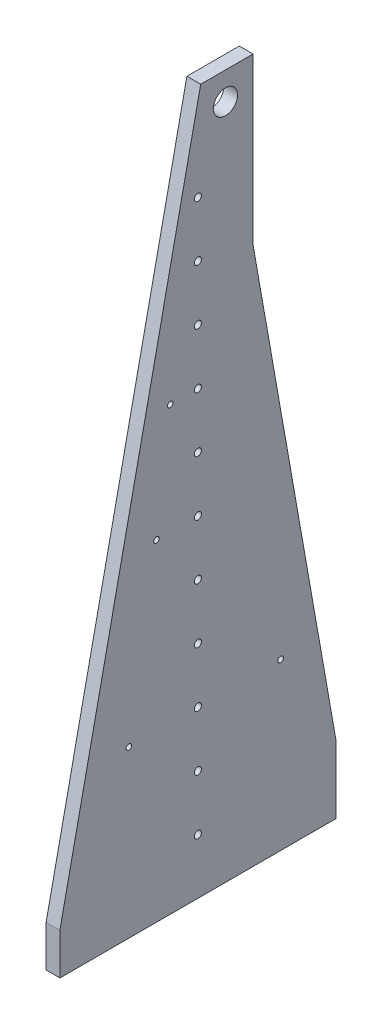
ISO-10303-21;
HEADER;
FILE_DESCRIPTION(('STEP AP214'),'2;1');
FILE_NAME('part.step','',(''),(''),'','','');
FILE_SCHEMA(('AUTOMOTIVE_DESIGN { 1 0 10303 214 1 1 1 1 }'));
ENDSEC;
DATA;
#1=APPLICATION_CONTEXT('core data for automotive mechanical design processes');
#2=APPLICATION_PROTOCOL_DEFINITION('international standard','automotive_design',2000,#1);
#3=PRODUCT_CONTEXT('',#1,'mechanical');
#4=PRODUCT('Part','Part','',(#3));
#5=PRODUCT_RELATED_PRODUCT_CATEGORY('part','',(#4));
#6=PRODUCT_DEFINITION_FORMATION('','',#4);
#7=PRODUCT_DEFINITION_CONTEXT('part definition',#1,'design');
#8=PRODUCT_DEFINITION('design','',#6,#7);
#9=PRODUCT_DEFINITION_SHAPE('','',#8);
#10=(LENGTH_UNIT() NAMED_UNIT(*) SI_UNIT(.MILLI.,.METRE.));
#11=(NAMED_UNIT(*) PLANE_ANGLE_UNIT() SI_UNIT($,.RADIAN.));
#12=(NAMED_UNIT(*) SI_UNIT($,.STERADIAN.) SOLID_ANGLE_UNIT());
#13=UNCERTAINTY_MEASURE_WITH_UNIT(LENGTH_MEASURE(1.E-05),#10,'distance_accuracy_value','');
#14=(GEOMETRIC_REPRESENTATION_CONTEXT(3) GLOBAL_UNCERTAINTY_ASSIGNED_CONTEXT((#13)) GLOBAL_UNIT_ASSIGNED_CONTEXT((#10,
#11,#12)) REPRESENTATION_CONTEXT('',''));
#15=CARTESIAN_POINT('',(0.,0.,0.));
#16=DIRECTION('',(0.,0.,1.));
#17=DIRECTION('',(1.,0.,0.));
#18=AXIS2_PLACEMENT_3D('',#15,#16,#17);
#19=CARTESIAN_POINT('',(12.7,38.1,127.));
#20=DIRECTION('',(0.,-0.20791169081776,-0.978147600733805));
#21=DIRECTION('',(0.,0.978147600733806,-0.20791169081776));
#22=AXIS2_PLACEMENT_3D('',#19,#20,#21);
#23=PLANE('',#22);
#24=DIRECTION('',(0.,-0.978147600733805,0.20791169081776));
#25=VECTOR('',#24,1.);
#26=CARTESIAN_POINT('',(0.,38.1,127.));
#27=LINE('',#26,#25);
#28=CARTESIAN_POINT('',(0.,647.7,-2.57447999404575));
#29=VERTEX_POINT('',#28);
#30=CARTESIAN_POINT('',(0.,38.1,127.));
#31=VERTEX_POINT('',#30);
#32=EDGE_CURVE('E186',#29,#31,#27,.T.);
#33=ORIENTED_EDGE('',*,*,#32,.T.);
#34=DIRECTION('',(-1.,0.,0.));
#35=VECTOR('',#34,1.);
#36=CARTESIAN_POINT('',(12.7,38.1,127.));
#37=LINE('',#36,#35);
#38=CARTESIAN_POINT('',(12.7,38.1,127.));
#39=VERTEX_POINT('',#38);
#40=EDGE_CURVE('E231',#39,#31,#37,.T.);
#41=ORIENTED_EDGE('',*,*,#40,.F.);
#42=DIRECTION('',(0.,-0.978147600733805,0.20791169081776));
#43=VECTOR('',#42,1.);
#44=CARTESIAN_POINT('',(12.7,38.1,127.));
#45=LINE('',#44,#43);
#46=CARTESIAN_POINT('',(12.7,647.7,-2.57447999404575));
#47=VERTEX_POINT('',#46);
#48=EDGE_CURVE('E187',#47,#39,#45,.T.);
#49=ORIENTED_EDGE('',*,*,#48,.F.);
#50=DIRECTION('',(-1.,0.,0.));
#51=VECTOR('',#50,1.);
#52=CARTESIAN_POINT('',(12.7,647.7,-2.57447999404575));
#53=LINE('',#52,#51);
#54=EDGE_CURVE('E203',#47,#29,#53,.T.);
#55=ORIENTED_EDGE('',*,*,#54,.T.);
#56=EDGE_LOOP('',(#33,#41,#49,#55));
#57=FACE_BOUND('',#56,.T.);
#58=ADVANCED_FACE('F37',(#57),#23,.F.);
#59=CARTESIAN_POINT('',(12.7,0.,127.));
#60=DIRECTION('',(0.,0.,-1.));
#61=DIRECTION('',(-1.,0.,0.));
#62=AXIS2_PLACEMENT_3D('',#59,#60,#61);
#63=PLANE('',#62);
#64=DIRECTION('',(0.,-1.,0.));
#65=VECTOR('',#64,1.);
#66=CARTESIAN_POINT('',(0.,0.,127.));
#67=LINE('',#66,#65);
#68=CARTESIAN_POINT('',(0.,0.,127.));
#69=VERTEX_POINT('',#68);
#70=EDGE_CURVE('E206',#31,#69,#67,.T.);
#71=ORIENTED_EDGE('',*,*,#70,.T.);
#72=DIRECTION('',(-1.,0.,0.));
#73=VECTOR('',#72,1.);
#74=CARTESIAN_POINT('',(12.7,0.,127.));
#75=LINE('',#74,#73);
#76=CARTESIAN_POINT('',(12.7,0.,127.));
#77=VERTEX_POINT('',#76);
#78=EDGE_CURVE('E228',#77,#69,#75,.T.);
#79=ORIENTED_EDGE('',*,*,#78,.F.);
#80=DIRECTION('',(0.,-1.,0.));
#81=VECTOR('',#80,1.);
#82=CARTESIAN_POINT('',(12.7,0.,127.));
#83=LINE('',#82,#81);
#84=EDGE_CURVE('E190',#39,#77,#83,.T.);
#85=ORIENTED_EDGE('',*,*,#84,.F.);
#86=ORIENTED_EDGE('',*,*,#40,.T.);
#87=EDGE_LOOP('',(#71,#79,#85,#86));
#88=FACE_BOUND('',#87,.T.);
#89=ADVANCED_FACE('F266',(#88),#63,.F.);
#90=CARTESIAN_POINT('',(12.7,0.,-127.));
#91=DIRECTION('',(0.,1.,0.));
#92=DIRECTION('',(0.,0.,1.));
#93=AXIS2_PLACEMENT_3D('',#90,#91,#92);
#94=PLANE('',#93);
#95=CARTESIAN_POINT('',(6.35,0.,-101.6));
#96=DIRECTION('',(0.,-1.,0.));
#97=DIRECTION('',(0.,0.,-1.));
#98=AXIS2_PLACEMENT_3D('',#95,#96,#97);
#99=CIRCLE('',#98,2.55269999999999);
#100=CARTESIAN_POINT('',(6.35,0.,-104.1527));
#101=VERTEX_POINT('',#100);
#102=EDGE_CURVE('E126',#101,#101,#99,.T.);
#103=ORIENTED_EDGE('',*,*,#102,.F.);
#104=EDGE_LOOP('',(#103));
#105=FACE_BOUND('',#104,.T.);
#106=CARTESIAN_POINT('',(6.34999999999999,0.,-50.8));
#107=DIRECTION('',(0.,-1.,0.));
#108=DIRECTION('',(0.,0.,-1.));
#109=AXIS2_PLACEMENT_3D('',#106,#107,#108);
#110=CIRCLE('',#109,2.55269999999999);
#111=CARTESIAN_POINT('',(6.34999999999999,0.,-53.3527));
#112=VERTEX_POINT('',#111);
#113=EDGE_CURVE('E125',#112,#112,#110,.T.);
#114=ORIENTED_EDGE('',*,*,#113,.F.);
#115=EDGE_LOOP('',(#114));
#116=FACE_BOUND('',#115,.T.);
#117=CARTESIAN_POINT('',(6.34999999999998,0.,0.));
#118=DIRECTION('',(0.,-1.,0.));
#119=DIRECTION('',(0.,0.,-1.));
#120=AXIS2_PLACEMENT_3D('',#117,#118,#119);
#121=CIRCLE('',#120,2.55269999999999);
#122=CARTESIAN_POINT('',(6.34999999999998,0.,-2.55269999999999));
#123=VERTEX_POINT('',#122);
#124=EDGE_CURVE('E138',#123,#123,#121,.T.);
#125=ORIENTED_EDGE('',*,*,#124,.F.);
#126=EDGE_LOOP('',(#125));
#127=FACE_BOUND('',#126,.T.);
#128=CARTESIAN_POINT('',(6.34999999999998,0.,50.8));
#129=DIRECTION('',(0.,-1.,0.));
#130=DIRECTION('',(0.,0.,-1.));
#131=AXIS2_PLACEMENT_3D('',#128,#129,#130);
#132=CIRCLE('',#131,2.55269999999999);
#133=CARTESIAN_POINT('',(6.34999999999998,0.,48.2473));
#134=VERTEX_POINT('',#133);
#135=EDGE_CURVE('E144',#134,#134,#132,.T.);
#136=ORIENTED_EDGE('',*,*,#135,.F.);
#137=EDGE_LOOP('',(#136));
#138=FACE_BOUND('',#137,.T.);
#139=CARTESIAN_POINT('',(6.34999999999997,0.,101.6));
#140=DIRECTION('',(0.,-1.,0.));
#141=DIRECTION('',(0.,0.,-1.));
#142=AXIS2_PLACEMENT_3D('',#139,#140,#141);
#143=CIRCLE('',#142,2.55269999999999);
#144=CARTESIAN_POINT('',(6.34999999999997,0.,99.0473));
#145=VERTEX_POINT('',#144);
#146=EDGE_CURVE('E150',#145,#145,#143,.T.);
#147=ORIENTED_EDGE('',*,*,#146,.F.);
#148=EDGE_LOOP('',(#147));
#149=FACE_BOUND('',#148,.T.);
#150=DIRECTION('',(0.,0.,-1.));
#151=VECTOR('',#150,1.);
#152=CARTESIAN_POINT('',(0.,0.,-127.));
#153=LINE('',#152,#151);
#154=CARTESIAN_POINT('',(0.,0.,-127.));
#155=VERTEX_POINT('',#154);
#156=EDGE_CURVE('E208',#69,#155,#153,.T.);
#157=ORIENTED_EDGE('',*,*,#156,.T.);
#158=DIRECTION('',(-1.,0.,0.));
#159=VECTOR('',#158,1.);
#160=CARTESIAN_POINT('',(12.7,0.,-127.));
#161=LINE('',#160,#159);
#162=CARTESIAN_POINT('',(12.7,0.,-127.));
#163=VERTEX_POINT('',#162);
#164=EDGE_CURVE('E225',#163,#155,#161,.T.);
#165=ORIENTED_EDGE('',*,*,#164,.F.);
#166=DIRECTION('',(0.,0.,-1.));
#167=VECTOR('',#166,1.);
#168=CARTESIAN_POINT('',(12.7,0.,-127.));
#169=LINE('',#168,#167);
#170=EDGE_CURVE('E193',#77,#163,#169,.T.);
#171=ORIENTED_EDGE('',*,*,#170,.F.);
#172=ORIENTED_EDGE('',*,*,#78,.T.);
#173=EDGE_LOOP('',(#157,#165,#171,#172));
#174=FACE_BOUND('',#173,.T.);
#175=ADVANCED_FACE('F270',(#105,#116,#127,#138,#149,#174),#94,.F.);
#176=CARTESIAN_POINT('',(12.7,63.1483253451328,-127.));
#177=DIRECTION('',(0.,0.,1.));
#178=DIRECTION('',(1.,0.,0.));
#179=AXIS2_PLACEMENT_3D('',#176,#177,#178);
#180=PLANE('',#179);
#181=DIRECTION('',(0.,1.,0.));
#182=VECTOR('',#181,1.);
#183=CARTESIAN_POINT('',(0.,63.1483253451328,-127.));
#184=LINE('',#183,#182);
#185=CARTESIAN_POINT('',(0.,63.1483253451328,-127.));
#186=VERTEX_POINT('',#185);
#187=EDGE_CURVE('E210',#155,#186,#184,.T.);
#188=ORIENTED_EDGE('',*,*,#187,.T.);
#189=DIRECTION('',(-1.,0.,0.));
#190=VECTOR('',#189,1.);
#191=CARTESIAN_POINT('',(12.7,63.1483253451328,-127.));
#192=LINE('',#191,#190);
#193=CARTESIAN_POINT('',(12.7,63.1483253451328,-127.));
#194=VERTEX_POINT('',#193);
#195=EDGE_CURVE('E222',#194,#186,#192,.T.);
#196=ORIENTED_EDGE('',*,*,#195,.F.);
#197=DIRECTION('',(0.,1.,0.));
#198=VECTOR('',#197,1.);
#199=CARTESIAN_POINT('',(12.7,63.1483253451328,-127.));
#200=LINE('',#199,#198);
#201=EDGE_CURVE('E195',#163,#194,#200,.T.);
#202=ORIENTED_EDGE('',*,*,#201,.F.);
#203=ORIENTED_EDGE('',*,*,#164,.T.);
#204=EDGE_LOOP('',(#188,#196,#202,#203));
#205=FACE_BOUND('',#204,.T.);
#206=ADVANCED_FACE('F276',(#205),#180,.F.);
#207=CARTESIAN_POINT('',(12.7,495.3,-50.7999999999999));
#208=DIRECTION('',(0.,-0.173648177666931,0.984807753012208));
#209=DIRECTION('',(0.,-0.984807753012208,-0.173648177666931));
#210=AXIS2_PLACEMENT_3D('',#207,#208,#209);
#211=PLANE('',#210);
#212=DIRECTION('',(0.,0.984807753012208,0.173648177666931));
#213=VECTOR('',#212,1.);
#214=CARTESIAN_POINT('',(0.,495.3,-50.7999999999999));
#215=LINE('',#214,#213);
#216=CARTESIAN_POINT('',(0.,494.468388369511,-50.9466355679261));
#217=VERTEX_POINT('',#216);
#218=EDGE_CURVE('E212',#186,#217,#215,.T.);
#219=ORIENTED_EDGE('',*,*,#218,.T.);
#220=DIRECTION('',(-1.,0.,0.));
#221=VECTOR('',#220,1.);
#222=CARTESIAN_POINT('',(12.7,494.468388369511,-50.9466355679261));
#223=LINE('',#222,#221);
#224=CARTESIAN_POINT('',(12.7,494.468388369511,-50.9466355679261));
#225=VERTEX_POINT('',#224);
#226=EDGE_CURVE('E52',#217,#225,#223,.F.);
#227=ORIENTED_EDGE('',*,*,#226,.T.);
#228=DIRECTION('',(0.,0.984807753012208,0.173648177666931));
#229=VECTOR('',#228,1.);
#230=CARTESIAN_POINT('',(12.7,495.3,-50.7999999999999));
#231=LINE('',#230,#229);
#232=EDGE_CURVE('E197',#194,#225,#231,.T.);
#233=ORIENTED_EDGE('',*,*,#232,.F.);
#234=ORIENTED_EDGE('',*,*,#195,.T.);
#235=EDGE_LOOP('',(#219,#227,#233,#234));
#236=FACE_BOUND('',#235,.T.);
#237=ADVANCED_FACE('F280',(#236),#211,.F.);
#238=CARTESIAN_POINT('',(12.7,647.7,-50.7999999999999));
#239=DIRECTION('',(0.,0.,1.));
#240=DIRECTION('',(0.,-1.,0.));
#241=AXIS2_PLACEMENT_3D('',#238,#239,#240);
#242=PLANE('',#241);
#243=DIRECTION('',(0.,1.,0.));
#244=VECTOR('',#243,1.);
#245=CARTESIAN_POINT('',(12.7,647.7,-50.7999999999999));
#246=LINE('',#245,#244);
#247=CARTESIAN_POINT('',(12.7,496.144440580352,-50.7999999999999));
#248=VERTEX_POINT('',#247);
#249=CARTESIAN_POINT('',(12.7,647.7,-50.7999999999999));
#250=VERTEX_POINT('',#249);
#251=EDGE_CURVE('E199',#248,#250,#246,.T.);
#252=ORIENTED_EDGE('',*,*,#251,.F.);
#253=DIRECTION('',(-1.,0.,0.));
#254=VECTOR('',#253,1.);
#255=CARTESIAN_POINT('',(0.,496.144440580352,-50.7999999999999));
#256=LINE('',#255,#254);
#257=CARTESIAN_POINT('',(0.,496.144440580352,-50.7999999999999));
#258=VERTEX_POINT('',#257);
#259=EDGE_CURVE('E234',#248,#258,#256,.T.);
#260=ORIENTED_EDGE('',*,*,#259,.T.);
#261=DIRECTION('',(0.,1.,0.));
#262=VECTOR('',#261,1.);
#263=CARTESIAN_POINT('',(0.,647.7,-50.7999999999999));
#264=LINE('',#263,#262);
#265=CARTESIAN_POINT('',(0.,647.7,-50.7999999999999));
#266=VERTEX_POINT('',#265);
#267=EDGE_CURVE('E214',#258,#266,#264,.T.);
#268=ORIENTED_EDGE('',*,*,#267,.T.);
#269=DIRECTION('',(-1.,0.,0.));
#270=VECTOR('',#269,1.);
#271=CARTESIAN_POINT('',(12.7,647.7,-50.7999999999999));
#272=LINE('',#271,#270);
#273=EDGE_CURVE('E219',#250,#266,#272,.T.);
#274=ORIENTED_EDGE('',*,*,#273,.F.);
#275=EDGE_LOOP('',(#252,#260,#268,#274));
#276=FACE_BOUND('',#275,.T.);
#277=ADVANCED_FACE('F240',(#276),#242,.F.);
#278=CARTESIAN_POINT('',(12.7,647.7,-2.57447999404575));
#279=DIRECTION('',(0.,-1.,0.));
#280=DIRECTION('',(0.,0.,-1.));
#281=AXIS2_PLACEMENT_3D('',#278,#279,#280);
#282=PLANE('',#281);
#283=DIRECTION('',(0.,0.,1.));
#284=VECTOR('',#283,1.);
#285=CARTESIAN_POINT('',(0.,647.7,-2.57447999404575));
#286=LINE('',#285,#284);
#287=EDGE_CURVE('E191',#266,#29,#286,.T.);
#288=ORIENTED_EDGE('',*,*,#287,.T.);
#289=ORIENTED_EDGE('',*,*,#54,.F.);
#290=DIRECTION('',(0.,0.,1.));
#291=VECTOR('',#290,1.);
#292=CARTESIAN_POINT('',(12.7,647.7,-2.57447999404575));
#293=LINE('',#292,#291);
#294=EDGE_CURVE('E201',#250,#47,#293,.T.);
#295=ORIENTED_EDGE('',*,*,#294,.F.);
#296=ORIENTED_EDGE('',*,*,#273,.T.);
#297=EDGE_LOOP('',(#288,#289,#295,#296));
#298=FACE_BOUND('',#297,.T.);
#299=ADVANCED_FACE('F249',(#298),#282,.F.);
#300=CARTESIAN_POINT('',(12.7,0.,0.));
#301=DIRECTION('',(-1.,0.,0.));
#302=DIRECTION('',(0.,0.,1.));
#303=AXIS2_PLACEMENT_3D('',#300,#301,#302);
#304=PLANE('',#303);
#305=CARTESIAN_POINT('',(12.7,558.8,0.));
#306=DIRECTION('',(-1.,0.,0.));
#307=DIRECTION('',(0.,0.,1.));
#308=AXIS2_PLACEMENT_3D('',#305,#306,#307);
#309=CIRCLE('',#308,3.26389999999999);
#310=CARTESIAN_POINT('',(12.7,558.8,3.26389999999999));
#311=VERTEX_POINT('',#310);
#312=EDGE_CURVE('E484',#311,#311,#309,.T.);
#313=ORIENTED_EDGE('',*,*,#312,.T.);
#314=EDGE_LOOP('',(#313));
#315=FACE_BOUND('',#314,.T.);
#316=CARTESIAN_POINT('',(12.7,508.,0.));
#317=DIRECTION('',(-1.,0.,0.));
#318=DIRECTION('',(0.,0.,1.));
#319=AXIS2_PLACEMENT_3D('',#316,#317,#318);
#320=CIRCLE('',#319,3.26389999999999);
#321=CARTESIAN_POINT('',(12.7,508.,3.26389999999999));
#322=VERTEX_POINT('',#321);
#323=EDGE_CURVE('E500',#322,#322,#320,.T.);
#324=ORIENTED_EDGE('',*,*,#323,.T.);
#325=EDGE_LOOP('',(#324));
#326=FACE_BOUND('',#325,.T.);
#327=CARTESIAN_POINT('',(12.7,457.2,0.));
#328=DIRECTION('',(-1.,0.,0.));
#329=DIRECTION('',(0.,0.,1.));
#330=AXIS2_PLACEMENT_3D('',#327,#328,#329);
#331=CIRCLE('',#330,3.26389999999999);
#332=CARTESIAN_POINT('',(12.7,457.2,3.26389999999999));
#333=VERTEX_POINT('',#332);
#334=EDGE_CURVE('E512',#333,#333,#331,.T.);
#335=ORIENTED_EDGE('',*,*,#334,.T.);
#336=EDGE_LOOP('',(#335));
#337=FACE_BOUND('',#336,.T.);
#338=CARTESIAN_POINT('',(12.7,406.4,0.));
#339=DIRECTION('',(-1.,0.,0.));
#340=DIRECTION('',(0.,0.,1.));
#341=AXIS2_PLACEMENT_3D('',#338,#339,#340);
#342=CIRCLE('',#341,3.26389999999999);
#343=CARTESIAN_POINT('',(12.7,406.4,3.26389999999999));
#344=VERTEX_POINT('',#343);
#345=EDGE_CURVE('E524',#344,#344,#342,.T.);
#346=ORIENTED_EDGE('',*,*,#345,.T.);
#347=EDGE_LOOP('',(#346));
#348=FACE_BOUND('',#347,.T.);
#349=CARTESIAN_POINT('',(12.7,355.6,0.));
#350=DIRECTION('',(-1.,0.,0.));
#351=DIRECTION('',(0.,0.,1.));
#352=AXIS2_PLACEMENT_3D('',#349,#350,#351);
#353=CIRCLE('',#352,3.26389999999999);
#354=CARTESIAN_POINT('',(12.7,355.6,3.26389999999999));
#355=VERTEX_POINT('',#354);
#356=EDGE_CURVE('E536',#355,#355,#353,.T.);
#357=ORIENTED_EDGE('',*,*,#356,.T.);
#358=EDGE_LOOP('',(#357));
#359=FACE_BOUND('',#358,.T.);
#360=CARTESIAN_POINT('',(12.7,304.8,0.));
#361=DIRECTION('',(-1.,0.,0.));
#362=DIRECTION('',(0.,0.,1.));
#363=AXIS2_PLACEMENT_3D('',#360,#361,#362);
#364=CIRCLE('',#363,3.26389999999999);
#365=CARTESIAN_POINT('',(12.7,304.8,3.26389999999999));
#366=VERTEX_POINT('',#365);
#367=EDGE_CURVE('E548',#366,#366,#364,.T.);
#368=ORIENTED_EDGE('',*,*,#367,.T.);
#369=EDGE_LOOP('',(#368));
#370=FACE_BOUND('',#369,.T.);
#371=CARTESIAN_POINT('',(12.7,254.,0.));
#372=DIRECTION('',(-1.,0.,0.));
#373=DIRECTION('',(0.,0.,1.));
#374=AXIS2_PLACEMENT_3D('',#371,#372,#373);
#375=CIRCLE('',#374,3.26389999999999);
#376=CARTESIAN_POINT('',(12.7,254.,3.26389999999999));
#377=VERTEX_POINT('',#376);
#378=EDGE_CURVE('E560',#377,#377,#375,.T.);
#379=ORIENTED_EDGE('',*,*,#378,.T.);
#380=EDGE_LOOP('',(#379));
#381=FACE_BOUND('',#380,.T.);
#382=CARTESIAN_POINT('',(12.7,203.2,0.));
#383=DIRECTION('',(-1.,0.,0.));
#384=DIRECTION('',(0.,0.,1.));
#385=AXIS2_PLACEMENT_3D('',#382,#383,#384);
#386=CIRCLE('',#385,3.26389999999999);
#387=CARTESIAN_POINT('',(12.7,203.2,3.26389999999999));
#388=VERTEX_POINT('',#387);
#389=EDGE_CURVE('E572',#388,#388,#386,.T.);
#390=ORIENTED_EDGE('',*,*,#389,.T.);
#391=EDGE_LOOP('',(#390));
#392=FACE_BOUND('',#391,.T.);
#393=CARTESIAN_POINT('',(12.7,152.4,0.));
#394=DIRECTION('',(-1.,0.,0.));
#395=DIRECTION('',(0.,0.,1.));
#396=AXIS2_PLACEMENT_3D('',#393,#394,#395);
#397=CIRCLE('',#396,3.26389999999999);
#398=CARTESIAN_POINT('',(12.7,152.4,3.26389999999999));
#399=VERTEX_POINT('',#398);
#400=EDGE_CURVE('E584',#399,#399,#397,.T.);
#401=ORIENTED_EDGE('',*,*,#400,.T.);
#402=EDGE_LOOP('',(#401));
#403=FACE_BOUND('',#402,.T.);
#404=CARTESIAN_POINT('',(12.7,101.6,0.));
#405=DIRECTION('',(-1.,0.,0.));
#406=DIRECTION('',(0.,0.,1.));
#407=AXIS2_PLACEMENT_3D('',#404,#405,#406);
#408=CIRCLE('',#407,3.2639);
#409=CARTESIAN_POINT('',(12.7,101.6,3.2639));
#410=VERTEX_POINT('',#409);
#411=EDGE_CURVE('E596',#410,#410,#408,.T.);
#412=ORIENTED_EDGE('',*,*,#411,.T.);
#413=EDGE_LOOP('',(#412));
#414=FACE_BOUND('',#413,.T.);
#415=CARTESIAN_POINT('',(12.7,50.8,0.));
#416=DIRECTION('',(-1.,0.,0.));
#417=DIRECTION('',(0.,0.,1.));
#418=AXIS2_PLACEMENT_3D('',#415,#416,#417);
#419=CIRCLE('',#418,3.2639);
#420=CARTESIAN_POINT('',(12.7,50.8,3.2639));
#421=VERTEX_POINT('',#420);
#422=EDGE_CURVE('E132',#421,#421,#419,.T.);
#423=ORIENTED_EDGE('',*,*,#422,.T.);
#424=EDGE_LOOP('',(#423));
#425=FACE_BOUND('',#424,.T.);
#426=CARTESIAN_POINT('',(12.7,406.4,25.4));
#427=DIRECTION('',(1.,0.,0.));
#428=DIRECTION('',(0.,0.,-1.));
#429=AXIS2_PLACEMENT_3D('',#426,#427,#428);
#430=CIRCLE('',#429,2.55270000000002);
#431=CARTESIAN_POINT('',(12.7,406.4,22.8473));
#432=VERTEX_POINT('',#431);
#433=EDGE_CURVE('E156',#432,#432,#430,.T.);
#434=ORIENTED_EDGE('',*,*,#433,.F.);
#435=EDGE_LOOP('',(#434));
#436=FACE_BOUND('',#435,.T.);
#437=CARTESIAN_POINT('',(12.7,304.8,38.1));
#438=DIRECTION('',(1.,0.,0.));
#439=DIRECTION('',(0.,0.,-1.));
#440=AXIS2_PLACEMENT_3D('',#437,#438,#439);
#441=CIRCLE('',#440,2.55270000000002);
#442=CARTESIAN_POINT('',(12.7,304.8,35.5473));
#443=VERTEX_POINT('',#442);
#444=EDGE_CURVE('E162',#443,#443,#441,.T.);
#445=ORIENTED_EDGE('',*,*,#444,.F.);
#446=EDGE_LOOP('',(#445));
#447=FACE_BOUND('',#446,.T.);
#448=CARTESIAN_POINT('',(12.7,152.4,63.5));
#449=DIRECTION('',(1.,0.,0.));
#450=DIRECTION('',(0.,0.,-1.));
#451=AXIS2_PLACEMENT_3D('',#448,#449,#450);
#452=CIRCLE('',#451,2.55269999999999);
#453=CARTESIAN_POINT('',(12.7,152.4,60.9473));
#454=VERTEX_POINT('',#453);
#455=EDGE_CURVE('E168',#454,#454,#452,.T.);
#456=ORIENTED_EDGE('',*,*,#455,.F.);
#457=EDGE_LOOP('',(#456));
#458=FACE_BOUND('',#457,.T.);
#459=CARTESIAN_POINT('',(12.7,152.4,-76.2));
#460=DIRECTION('',(1.,0.,0.));
#461=DIRECTION('',(0.,0.,-1.));
#462=AXIS2_PLACEMENT_3D('',#459,#460,#461);
#463=CIRCLE('',#462,2.55269999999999);
#464=CARTESIAN_POINT('',(12.7,152.4,-78.7527));
#465=VERTEX_POINT('',#464);
#466=EDGE_CURVE('E174',#465,#465,#463,.T.);
#467=ORIENTED_EDGE('',*,*,#466,.F.);
#468=EDGE_LOOP('',(#467));
#469=FACE_BOUND('',#468,.T.);
#470=CARTESIAN_POINT('',(12.7,622.3,-25.3999999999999));
#471=DIRECTION('',(1.,0.,0.));
#472=DIRECTION('',(0.,0.,-1.));
#473=AXIS2_PLACEMENT_3D('',#470,#471,#472);
#474=CIRCLE('',#473,11.1125);
#475=CARTESIAN_POINT('',(12.7,622.3,-36.5124999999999));
#476=VERTEX_POINT('',#475);
#477=EDGE_CURVE('E180',#476,#476,#474,.T.);
#478=ORIENTED_EDGE('',*,*,#477,.F.);
#479=EDGE_LOOP('',(#478));
#480=FACE_BOUND('',#479,.T.);
#481=ORIENTED_EDGE('',*,*,#48,.T.);
#482=ORIENTED_EDGE('',*,*,#84,.T.);
#483=ORIENTED_EDGE('',*,*,#170,.T.);
#484=ORIENTED_EDGE('',*,*,#201,.T.);
#485=ORIENTED_EDGE('',*,*,#232,.T.);
#486=CARTESIAN_POINT('',(12.7,496.144440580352,-60.4519999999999));
#487=DIRECTION('',(-1.,0.,0.));
#488=DIRECTION('',(0.,0.,1.));
#489=AXIS2_PLACEMENT_3D('',#486,#487,#488);
#490=CIRCLE('',#489,9.652);
#491=EDGE_CURVE('E11',#225,#248,#490,.T.);
#492=ORIENTED_EDGE('',*,*,#491,.T.);
#493=ORIENTED_EDGE('',*,*,#251,.T.);
#494=ORIENTED_EDGE('',*,*,#294,.T.);
#495=EDGE_LOOP('',(#481,#482,#483,#484,#485,#492,#493,#494));
#496=FACE_BOUND('',#495,.T.);
#497=ADVANCED_FACE('F255',(#315,#326,#337,#348,#359,#370,#381,#392,#403,#414,#425,#436,#447,
#458,#469,#480,#496),#304,.F.);
#498=CARTESIAN_POINT('',(0.,0.,0.));
#499=DIRECTION('',(-1.,0.,0.));
#500=DIRECTION('',(0.,0.,1.));
#501=AXIS2_PLACEMENT_3D('',#498,#499,#500);
#502=PLANE('',#501);
#503=CARTESIAN_POINT('',(0.,558.8,0.));
#504=DIRECTION('',(-1.,0.,0.));
#505=DIRECTION('',(0.,0.,1.));
#506=AXIS2_PLACEMENT_3D('',#503,#504,#505);
#507=CIRCLE('',#506,5.55625000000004);
#508=CARTESIAN_POINT('',(0.,558.8,5.55625000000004));
#509=VERTEX_POINT('',#508);
#510=EDGE_CURVE('E482',#509,#509,#507,.T.);
#511=ORIENTED_EDGE('',*,*,#510,.F.);
#512=EDGE_LOOP('',(#511));
#513=FACE_BOUND('',#512,.T.);
#514=CARTESIAN_POINT('',(0.,508.,0.));
#515=DIRECTION('',(-1.,0.,0.));
#516=DIRECTION('',(0.,0.,1.));
#517=AXIS2_PLACEMENT_3D('',#514,#515,#516);
#518=CIRCLE('',#517,5.55625000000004);
#519=CARTESIAN_POINT('',(0.,508.,5.55625000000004));
#520=VERTEX_POINT('',#519);
#521=EDGE_CURVE('E491',#520,#520,#518,.T.);
#522=ORIENTED_EDGE('',*,*,#521,.F.);
#523=EDGE_LOOP('',(#522));
#524=FACE_BOUND('',#523,.T.);
#525=CARTESIAN_POINT('',(0.,457.2,0.));
#526=DIRECTION('',(-1.,0.,0.));
#527=DIRECTION('',(0.,0.,1.));
#528=AXIS2_PLACEMENT_3D('',#525,#526,#527);
#529=CIRCLE('',#528,5.55624999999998);
#530=CARTESIAN_POINT('',(0.,457.2,5.55624999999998));
#531=VERTEX_POINT('',#530);
#532=EDGE_CURVE('E503',#531,#531,#529,.T.);
#533=ORIENTED_EDGE('',*,*,#532,.F.);
#534=EDGE_LOOP('',(#533));
#535=FACE_BOUND('',#534,.T.);
#536=CARTESIAN_POINT('',(0.,406.4,0.));
#537=DIRECTION('',(-1.,0.,0.));
#538=DIRECTION('',(0.,0.,1.));
#539=AXIS2_PLACEMENT_3D('',#536,#537,#538);
#540=CIRCLE('',#539,5.55624999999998);
#541=CARTESIAN_POINT('',(0.,406.4,5.55624999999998));
#542=VERTEX_POINT('',#541);
#543=EDGE_CURVE('E515',#542,#542,#540,.T.);
#544=ORIENTED_EDGE('',*,*,#543,.F.);
#545=EDGE_LOOP('',(#544));
#546=FACE_BOUND('',#545,.T.);
#547=CARTESIAN_POINT('',(0.,355.6,0.));
#548=DIRECTION('',(-1.,0.,0.));
#549=DIRECTION('',(0.,0.,1.));
#550=AXIS2_PLACEMENT_3D('',#547,#548,#549);
#551=CIRCLE('',#550,5.55624999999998);
#552=CARTESIAN_POINT('',(0.,355.6,5.55624999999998));
#553=VERTEX_POINT('',#552);
#554=EDGE_CURVE('E527',#553,#553,#551,.T.);
#555=ORIENTED_EDGE('',*,*,#554,.F.);
#556=EDGE_LOOP('',(#555));
#557=FACE_BOUND('',#556,.T.);
#558=CARTESIAN_POINT('',(0.,304.8,0.));
#559=DIRECTION('',(-1.,0.,0.));
#560=DIRECTION('',(0.,0.,1.));
#561=AXIS2_PLACEMENT_3D('',#558,#559,#560);
#562=CIRCLE('',#561,5.55624999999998);
#563=CARTESIAN_POINT('',(0.,304.8,5.55624999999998));
#564=VERTEX_POINT('',#563);
#565=EDGE_CURVE('E539',#564,#564,#562,.T.);
#566=ORIENTED_EDGE('',*,*,#565,.F.);
#567=EDGE_LOOP('',(#566));
#568=FACE_BOUND('',#567,.T.);
#569=CARTESIAN_POINT('',(0.,254.,0.));
#570=DIRECTION('',(-1.,0.,0.));
#571=DIRECTION('',(0.,0.,1.));
#572=AXIS2_PLACEMENT_3D('',#569,#570,#571);
#573=CIRCLE('',#572,5.55624999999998);
#574=CARTESIAN_POINT('',(0.,254.,5.55624999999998));
#575=VERTEX_POINT('',#574);
#576=EDGE_CURVE('E551',#575,#575,#573,.T.);
#577=ORIENTED_EDGE('',*,*,#576,.F.);
#578=EDGE_LOOP('',(#577));
#579=FACE_BOUND('',#578,.T.);
#580=CARTESIAN_POINT('',(0.,203.2,0.));
#581=DIRECTION('',(-1.,0.,0.));
#582=DIRECTION('',(0.,0.,1.));
#583=AXIS2_PLACEMENT_3D('',#580,#581,#582);
#584=CIRCLE('',#583,5.55624999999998);
#585=CARTESIAN_POINT('',(0.,203.2,5.55624999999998));
#586=VERTEX_POINT('',#585);
#587=EDGE_CURVE('E563',#586,#586,#584,.T.);
#588=ORIENTED_EDGE('',*,*,#587,.F.);
#589=EDGE_LOOP('',(#588));
#590=FACE_BOUND('',#589,.T.);
#591=CARTESIAN_POINT('',(0.,152.4,0.));
#592=DIRECTION('',(-1.,0.,0.));
#593=DIRECTION('',(0.,0.,1.));
#594=AXIS2_PLACEMENT_3D('',#591,#592,#593);
#595=CIRCLE('',#594,5.55624999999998);
#596=CARTESIAN_POINT('',(0.,152.4,5.55624999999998));
#597=VERTEX_POINT('',#596);
#598=EDGE_CURVE('E575',#597,#597,#595,.T.);
#599=ORIENTED_EDGE('',*,*,#598,.F.);
#600=EDGE_LOOP('',(#599));
#601=FACE_BOUND('',#600,.T.);
#602=CARTESIAN_POINT('',(0.,101.6,0.));
#603=DIRECTION('',(-1.,0.,0.));
#604=DIRECTION('',(0.,0.,1.));
#605=AXIS2_PLACEMENT_3D('',#602,#603,#604);
#606=CIRCLE('',#605,5.55625);
#607=CARTESIAN_POINT('',(0.,101.6,5.55625));
#608=VERTEX_POINT('',#607);
#609=EDGE_CURVE('E587',#608,#608,#606,.T.);
#610=ORIENTED_EDGE('',*,*,#609,.F.);
#611=EDGE_LOOP('',(#610));
#612=FACE_BOUND('',#611,.T.);
#613=CARTESIAN_POINT('',(0.,50.8,0.));
#614=DIRECTION('',(-1.,0.,0.));
#615=DIRECTION('',(0.,0.,1.));
#616=AXIS2_PLACEMENT_3D('',#613,#614,#615);
#617=CIRCLE('',#616,5.55625);
#618=CARTESIAN_POINT('',(0.,50.8,5.55625));
#619=VERTEX_POINT('',#618);
#620=EDGE_CURVE('E599',#619,#619,#617,.T.);
#621=ORIENTED_EDGE('',*,*,#620,.F.);
#622=EDGE_LOOP('',(#621));
#623=FACE_BOUND('',#622,.T.);
#624=CARTESIAN_POINT('',(0.,406.4,25.4));
#625=DIRECTION('',(1.,0.,0.));
#626=DIRECTION('',(0.,0.,-1.));
#627=AXIS2_PLACEMENT_3D('',#624,#625,#626);
#628=CIRCLE('',#627,2.55270000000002);
#629=CARTESIAN_POINT('',(0.,406.4,22.8473));
#630=VERTEX_POINT('',#629);
#631=EDGE_CURVE('E159',#630,#630,#628,.T.);
#632=ORIENTED_EDGE('',*,*,#631,.T.);
#633=EDGE_LOOP('',(#632));
#634=FACE_BOUND('',#633,.T.);
#635=CARTESIAN_POINT('',(0.,304.8,38.1));
#636=DIRECTION('',(1.,0.,0.));
#637=DIRECTION('',(0.,0.,-1.));
#638=AXIS2_PLACEMENT_3D('',#635,#636,#637);
#639=CIRCLE('',#638,2.55270000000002);
#640=CARTESIAN_POINT('',(0.,304.8,35.5473));
#641=VERTEX_POINT('',#640);
#642=EDGE_CURVE('E165',#641,#641,#639,.T.);
#643=ORIENTED_EDGE('',*,*,#642,.T.);
#644=EDGE_LOOP('',(#643));
#645=FACE_BOUND('',#644,.T.);
#646=CARTESIAN_POINT('',(0.,152.4,63.5));
#647=DIRECTION('',(1.,0.,0.));
#648=DIRECTION('',(0.,0.,-1.));
#649=AXIS2_PLACEMENT_3D('',#646,#647,#648);
#650=CIRCLE('',#649,2.55269999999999);
#651=CARTESIAN_POINT('',(0.,152.4,60.9473));
#652=VERTEX_POINT('',#651);
#653=EDGE_CURVE('E171',#652,#652,#650,.T.);
#654=ORIENTED_EDGE('',*,*,#653,.T.);
#655=EDGE_LOOP('',(#654));
#656=FACE_BOUND('',#655,.T.);
#657=CARTESIAN_POINT('',(0.,152.4,-76.2));
#658=DIRECTION('',(1.,0.,0.));
#659=DIRECTION('',(0.,0.,-1.));
#660=AXIS2_PLACEMENT_3D('',#657,#658,#659);
#661=CIRCLE('',#660,2.55269999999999);
#662=CARTESIAN_POINT('',(0.,152.4,-78.7527));
#663=VERTEX_POINT('',#662);
#664=EDGE_CURVE('E177',#663,#663,#661,.T.);
#665=ORIENTED_EDGE('',*,*,#664,.T.);
#666=EDGE_LOOP('',(#665));
#667=FACE_BOUND('',#666,.T.);
#668=CARTESIAN_POINT('',(0.,622.3,-25.3999999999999));
#669=DIRECTION('',(1.,0.,0.));
#670=DIRECTION('',(0.,0.,-1.));
#671=AXIS2_PLACEMENT_3D('',#668,#669,#670);
#672=CIRCLE('',#671,11.1125);
#673=CARTESIAN_POINT('',(0.,622.3,-36.5124999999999));
#674=VERTEX_POINT('',#673);
#675=EDGE_CURVE('E183',#674,#674,#672,.T.);
#676=ORIENTED_EDGE('',*,*,#675,.T.);
#677=EDGE_LOOP('',(#676));
#678=FACE_BOUND('',#677,.T.);
#679=ORIENTED_EDGE('',*,*,#32,.F.);
#680=ORIENTED_EDGE('',*,*,#287,.F.);
#681=ORIENTED_EDGE('',*,*,#267,.F.);
#682=CARTESIAN_POINT('',(0.,496.144440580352,-60.4519999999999));
#683=DIRECTION('',(-1.,0.,0.));
#684=DIRECTION('',(0.,0.,1.));
#685=AXIS2_PLACEMENT_3D('',#682,#683,#684);
#686=CIRCLE('',#685,9.652);
#687=EDGE_CURVE('E45',#258,#217,#686,.F.);
#688=ORIENTED_EDGE('',*,*,#687,.T.);
#689=ORIENTED_EDGE('',*,*,#218,.F.);
#690=ORIENTED_EDGE('',*,*,#187,.F.);
#691=ORIENTED_EDGE('',*,*,#156,.F.);
#692=ORIENTED_EDGE('',*,*,#70,.F.);
#693=EDGE_LOOP('',(#679,#680,#681,#688,#689,#690,#691,#692));
#694=FACE_BOUND('',#693,.T.);
#695=ADVANCED_FACE('F246',(#513,#524,#535,#546,#557,#568,#579,#590,#601,#612,#623,#634,#645,
#656,#667,#678,#694),#502,.T.);
#696=CARTESIAN_POINT('',(12.7,622.3,-25.3999999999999));
#697=DIRECTION('',(1.,0.,0.));
#698=DIRECTION('',(0.,0.,-1.));
#699=AXIS2_PLACEMENT_3D('',#696,#697,#698);
#700=CYLINDRICAL_SURFACE('',#699,11.1125);
#701=ORIENTED_EDGE('',*,*,#675,.F.);
#702=EDGE_LOOP('',(#701));
#703=FACE_BOUND('',#702,.T.);
#704=ORIENTED_EDGE('',*,*,#477,.T.);
#705=EDGE_LOOP('',(#704));
#706=FACE_BOUND('',#705,.T.);
#707=ADVANCED_FACE('F290',(#703,#706),#700,.F.);
#708=CARTESIAN_POINT('',(12.7,152.4,-76.2));
#709=DIRECTION('',(1.,0.,0.));
#710=DIRECTION('',(0.,0.,-1.));
#711=AXIS2_PLACEMENT_3D('',#708,#709,#710);
#712=CYLINDRICAL_SURFACE('',#711,2.55269999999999);
#713=ORIENTED_EDGE('',*,*,#664,.F.);
#714=EDGE_LOOP('',(#713));
#715=FACE_BOUND('',#714,.T.);
#716=ORIENTED_EDGE('',*,*,#466,.T.);
#717=EDGE_LOOP('',(#716));
#718=FACE_BOUND('',#717,.T.);
#719=ADVANCED_FACE('F297',(#715,#718),#712,.F.);
#720=CARTESIAN_POINT('',(12.7,152.4,63.5));
#721=DIRECTION('',(1.,0.,0.));
#722=DIRECTION('',(0.,0.,-1.));
#723=AXIS2_PLACEMENT_3D('',#720,#721,#722);
#724=CYLINDRICAL_SURFACE('',#723,2.55269999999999);
#725=ORIENTED_EDGE('',*,*,#653,.F.);
#726=EDGE_LOOP('',(#725));
#727=FACE_BOUND('',#726,.T.);
#728=ORIENTED_EDGE('',*,*,#455,.T.);
#729=EDGE_LOOP('',(#728));
#730=FACE_BOUND('',#729,.T.);
#731=ADVANCED_FACE('F301',(#727,#730),#724,.F.);
#732=CARTESIAN_POINT('',(12.7,304.8,38.1));
#733=DIRECTION('',(1.,0.,0.));
#734=DIRECTION('',(0.,0.,-1.));
#735=AXIS2_PLACEMENT_3D('',#732,#733,#734);
#736=CYLINDRICAL_SURFACE('',#735,2.55270000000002);
#737=ORIENTED_EDGE('',*,*,#642,.F.);
#738=EDGE_LOOP('',(#737));
#739=FACE_BOUND('',#738,.T.);
#740=ORIENTED_EDGE('',*,*,#444,.T.);
#741=EDGE_LOOP('',(#740));
#742=FACE_BOUND('',#741,.T.);
#743=ADVANCED_FACE('F305',(#739,#742),#736,.F.);
#744=CARTESIAN_POINT('',(12.7,406.4,25.4));
#745=DIRECTION('',(1.,0.,0.));
#746=DIRECTION('',(0.,0.,-1.));
#747=AXIS2_PLACEMENT_3D('',#744,#745,#746);
#748=CYLINDRICAL_SURFACE('',#747,2.55270000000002);
#749=ORIENTED_EDGE('',*,*,#631,.F.);
#750=EDGE_LOOP('',(#749));
#751=FACE_BOUND('',#750,.T.);
#752=ORIENTED_EDGE('',*,*,#433,.T.);
#753=EDGE_LOOP('',(#752));
#754=FACE_BOUND('',#753,.T.);
#755=ADVANCED_FACE('F309',(#751,#754),#748,.F.);
#756=CARTESIAN_POINT('',(6.34999999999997,13.335,101.6));
#757=DIRECTION('',(0.,-1.,0.));
#758=DIRECTION('',(0.,0.,-1.));
#759=AXIS2_PLACEMENT_3D('',#756,#757,#758);
#760=CONICAL_SURFACE('',#759,2.55269999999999,1.02974425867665);
#761=CARTESIAN_POINT('',(6.34999999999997,14.8688169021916,101.6));
#762=VERTEX_POINT('',#761);
#763=VERTEX_LOOP('',#762);
#764=FACE_BOUND('',#763,.T.);
#765=CARTESIAN_POINT('',(6.34999999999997,13.335,101.6));
#766=DIRECTION('',(0.,-1.,0.));
#767=DIRECTION('',(0.,0.,-1.));
#768=AXIS2_PLACEMENT_3D('',#765,#766,#767);
#769=CIRCLE('',#768,2.55269999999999);
#770=CARTESIAN_POINT('',(6.34999999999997,13.335,99.0473));
#771=VERTEX_POINT('',#770);
#772=EDGE_CURVE('E153',#771,#771,#769,.T.);
#773=ORIENTED_EDGE('',*,*,#772,.T.);
#774=EDGE_LOOP('',(#773));
#775=FACE_BOUND('',#774,.T.);
#776=ADVANCED_FACE('F313',(#764,#775),#760,.F.);
#777=CARTESIAN_POINT('',(6.34999999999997,0.,101.6));
#778=DIRECTION('',(0.,-1.,0.));
#779=DIRECTION('',(0.,0.,-1.));
#780=AXIS2_PLACEMENT_3D('',#777,#778,#779);
#781=CYLINDRICAL_SURFACE('',#780,2.55269999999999);
#782=ORIENTED_EDGE('',*,*,#772,.F.);
#783=EDGE_LOOP('',(#782));
#784=FACE_BOUND('',#783,.T.);
#785=ORIENTED_EDGE('',*,*,#146,.T.);
#786=EDGE_LOOP('',(#785));
#787=FACE_BOUND('',#786,.T.);
#788=ADVANCED_FACE('F317',(#784,#787),#781,.F.);
#789=CARTESIAN_POINT('',(6.34999999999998,13.335,50.8));
#790=DIRECTION('',(0.,-1.,0.));
#791=DIRECTION('',(0.,0.,-1.));
#792=AXIS2_PLACEMENT_3D('',#789,#790,#791);
#793=CONICAL_SURFACE('',#792,2.55269999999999,1.02974425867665);
#794=CARTESIAN_POINT('',(6.34999999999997,14.8688169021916,50.8));
#795=VERTEX_POINT('',#794);
#796=VERTEX_LOOP('',#795);
#797=FACE_BOUND('',#796,.T.);
#798=CARTESIAN_POINT('',(6.34999999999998,13.335,50.8));
#799=DIRECTION('',(0.,-1.,0.));
#800=DIRECTION('',(0.,0.,-1.));
#801=AXIS2_PLACEMENT_3D('',#798,#799,#800);
#802=CIRCLE('',#801,2.55269999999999);
#803=CARTESIAN_POINT('',(6.34999999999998,13.335,48.2473));
#804=VERTEX_POINT('',#803);
#805=EDGE_CURVE('E147',#804,#804,#802,.T.);
#806=ORIENTED_EDGE('',*,*,#805,.T.);
#807=EDGE_LOOP('',(#806));
#808=FACE_BOUND('',#807,.T.);
#809=ADVANCED_FACE('F321',(#797,#808),#793,.F.);
#810=CARTESIAN_POINT('',(6.34999999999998,0.,50.8));
#811=DIRECTION('',(0.,-1.,0.));
#812=DIRECTION('',(0.,0.,-1.));
#813=AXIS2_PLACEMENT_3D('',#810,#811,#812);
#814=CYLINDRICAL_SURFACE('',#813,2.55269999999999);
#815=ORIENTED_EDGE('',*,*,#805,.F.);
#816=EDGE_LOOP('',(#815));
#817=FACE_BOUND('',#816,.T.);
#818=ORIENTED_EDGE('',*,*,#135,.T.);
#819=EDGE_LOOP('',(#818));
#820=FACE_BOUND('',#819,.T.);
#821=ADVANCED_FACE('F325',(#817,#820),#814,.F.);
#822=CARTESIAN_POINT('',(6.34999999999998,13.335,0.));
#823=DIRECTION('',(0.,-1.,0.));
#824=DIRECTION('',(0.,0.,-1.));
#825=AXIS2_PLACEMENT_3D('',#822,#823,#824);
#826=CONICAL_SURFACE('',#825,2.55269999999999,1.02974425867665);
#827=CARTESIAN_POINT('',(6.34999999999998,14.8688169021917,0.));
#828=VERTEX_POINT('',#827);
#829=VERTEX_LOOP('',#828);
#830=FACE_BOUND('',#829,.T.);
#831=CARTESIAN_POINT('',(6.34999999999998,13.335,0.));
#832=DIRECTION('',(0.,-1.,0.));
#833=DIRECTION('',(0.,0.,-1.));
#834=AXIS2_PLACEMENT_3D('',#831,#832,#833);
#835=CIRCLE('',#834,2.55269999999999);
#836=CARTESIAN_POINT('',(6.34999999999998,13.335,-2.55269999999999));
#837=VERTEX_POINT('',#836);
#838=EDGE_CURVE('E141',#837,#837,#835,.T.);
#839=ORIENTED_EDGE('',*,*,#838,.T.);
#840=EDGE_LOOP('',(#839));
#841=FACE_BOUND('',#840,.T.);
#842=ADVANCED_FACE('F329',(#830,#841),#826,.F.);
#843=CARTESIAN_POINT('',(6.34999999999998,0.,0.));
#844=DIRECTION('',(0.,-1.,0.));
#845=DIRECTION('',(0.,0.,-1.));
#846=AXIS2_PLACEMENT_3D('',#843,#844,#845);
#847=CYLINDRICAL_SURFACE('',#846,2.55269999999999);
#848=ORIENTED_EDGE('',*,*,#838,.F.);
#849=EDGE_LOOP('',(#848));
#850=FACE_BOUND('',#849,.T.);
#851=ORIENTED_EDGE('',*,*,#124,.T.);
#852=EDGE_LOOP('',(#851));
#853=FACE_BOUND('',#852,.T.);
#854=ADVANCED_FACE('F333',(#850,#853),#847,.F.);
#855=CARTESIAN_POINT('',(6.34999999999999,13.335,-50.8));
#856=DIRECTION('',(0.,-1.,0.));
#857=DIRECTION('',(0.,0.,-1.));
#858=AXIS2_PLACEMENT_3D('',#855,#856,#857);
#859=CONICAL_SURFACE('',#858,2.55269999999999,1.02974425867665);
#860=CARTESIAN_POINT('',(6.34999999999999,14.8688169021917,-50.8));
#861=VERTEX_POINT('',#860);
#862=VERTEX_LOOP('',#861);
#863=FACE_BOUND('',#862,.T.);
#864=CARTESIAN_POINT('',(6.34999999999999,13.335,-50.8));
#865=DIRECTION('',(0.,-1.,0.));
#866=DIRECTION('',(0.,0.,-1.));
#867=AXIS2_PLACEMENT_3D('',#864,#865,#866);
#868=CIRCLE('',#867,2.55269999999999);
#869=CARTESIAN_POINT('',(6.34999999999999,13.335,-53.3527));
#870=VERTEX_POINT('',#869);
#871=EDGE_CURVE('E129',#870,#870,#868,.T.);
#872=ORIENTED_EDGE('',*,*,#871,.T.);
#873=EDGE_LOOP('',(#872));
#874=FACE_BOUND('',#873,.T.);
#875=ADVANCED_FACE('F337',(#863,#874),#859,.F.);
#876=CARTESIAN_POINT('',(6.34999999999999,0.,-50.8));
#877=DIRECTION('',(0.,-1.,0.));
#878=DIRECTION('',(0.,0.,-1.));
#879=AXIS2_PLACEMENT_3D('',#876,#877,#878);
#880=CYLINDRICAL_SURFACE('',#879,2.55269999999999);
#881=ORIENTED_EDGE('',*,*,#871,.F.);
#882=EDGE_LOOP('',(#881));
#883=FACE_BOUND('',#882,.T.);
#884=ORIENTED_EDGE('',*,*,#113,.T.);
#885=EDGE_LOOP('',(#884));
#886=FACE_BOUND('',#885,.T.);
#887=ADVANCED_FACE('F119',(#883,#886),#880,.F.);
#888=CARTESIAN_POINT('',(6.35,13.335,-101.6));
#889=DIRECTION('',(0.,-1.,0.));
#890=DIRECTION('',(0.,0.,-1.));
#891=AXIS2_PLACEMENT_3D('',#888,#889,#890);
#892=CONICAL_SURFACE('',#891,2.55269999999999,1.02974425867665);
#893=CARTESIAN_POINT('',(6.34999999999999,14.8688169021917,-101.6));
#894=VERTEX_POINT('',#893);
#895=VERTEX_LOOP('',#894);
#896=FACE_BOUND('',#895,.T.);
#897=CARTESIAN_POINT('',(6.35,13.335,-101.6));
#898=DIRECTION('',(0.,-1.,0.));
#899=DIRECTION('',(0.,0.,-1.));
#900=AXIS2_PLACEMENT_3D('',#897,#898,#899);
#901=CIRCLE('',#900,2.55269999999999);
#902=CARTESIAN_POINT('',(6.35,13.335,-104.1527));
#903=VERTEX_POINT('',#902);
#904=EDGE_CURVE('E123',#903,#903,#901,.T.);
#905=ORIENTED_EDGE('',*,*,#904,.T.);
#906=EDGE_LOOP('',(#905));
#907=FACE_BOUND('',#906,.T.);
#908=ADVANCED_FACE('F115',(#896,#907),#892,.F.);
#909=CARTESIAN_POINT('',(6.35,0.,-101.6));
#910=DIRECTION('',(0.,-1.,0.));
#911=DIRECTION('',(0.,0.,-1.));
#912=AXIS2_PLACEMENT_3D('',#909,#910,#911);
#913=CYLINDRICAL_SURFACE('',#912,2.55269999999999);
#914=ORIENTED_EDGE('',*,*,#904,.F.);
#915=EDGE_LOOP('',(#914));
#916=FACE_BOUND('',#915,.T.);
#917=ORIENTED_EDGE('',*,*,#102,.T.);
#918=EDGE_LOOP('',(#917));
#919=FACE_BOUND('',#918,.T.);
#920=ADVANCED_FACE('F118',(#916,#919),#913,.F.);
#921=CARTESIAN_POINT('',(0.,50.8,0.));
#922=DIRECTION('',(-1.,0.,0.));
#923=DIRECTION('',(0.,0.,1.));
#924=AXIS2_PLACEMENT_3D('',#921,#922,#923);
#925=CYLINDRICAL_SURFACE('',#924,3.2639);
#926=ORIENTED_EDGE('',*,*,#422,.F.);
#927=EDGE_LOOP('',(#926));
#928=FACE_BOUND('',#927,.T.);
#929=CARTESIAN_POINT('',(6.35,50.8,0.));
#930=DIRECTION('',(-1.,0.,0.));
#931=DIRECTION('',(0.,0.,1.));
#932=AXIS2_PLACEMENT_3D('',#929,#930,#931);
#933=CIRCLE('',#932,3.2639);
#934=CARTESIAN_POINT('',(6.35,50.8,3.2639));
#935=VERTEX_POINT('',#934);
#936=EDGE_CURVE('E605',#935,#935,#933,.T.);
#937=ORIENTED_EDGE('',*,*,#936,.T.);
#938=EDGE_LOOP('',(#937));
#939=FACE_BOUND('',#938,.T.);
#940=ADVANCED_FACE('F347',(#928,#939),#925,.F.);
#941=CARTESIAN_POINT('',(6.35,54.0639,0.));
#942=DIRECTION('',(1.,0.,0.));
#943=DIRECTION('',(0.,0.,-1.));
#944=AXIS2_PLACEMENT_3D('',#941,#942,#943);
#945=PLANE('',#944);
#946=ORIENTED_EDGE('',*,*,#936,.F.);
#947=EDGE_LOOP('',(#946));
#948=FACE_BOUND('',#947,.T.);
#949=CARTESIAN_POINT('',(6.35,50.8,0.));
#950=DIRECTION('',(-1.,0.,0.));
#951=DIRECTION('',(0.,0.,1.));
#952=AXIS2_PLACEMENT_3D('',#949,#950,#951);
#953=CIRCLE('',#952,5.55625);
#954=CARTESIAN_POINT('',(6.35,50.8,5.55625));
#955=VERTEX_POINT('',#954);
#956=EDGE_CURVE('E602',#955,#955,#953,.T.);
#957=ORIENTED_EDGE('',*,*,#956,.T.);
#958=EDGE_LOOP('',(#957));
#959=FACE_BOUND('',#958,.T.);
#960=ADVANCED_FACE('F350',(#948,#959),#945,.F.);
#961=CARTESIAN_POINT('',(0.,50.8,0.));
#962=DIRECTION('',(-1.,0.,0.));
#963=DIRECTION('',(0.,0.,1.));
#964=AXIS2_PLACEMENT_3D('',#961,#962,#963);
#965=CYLINDRICAL_SURFACE('',#964,5.55625);
#966=ORIENTED_EDGE('',*,*,#956,.F.);
#967=EDGE_LOOP('',(#966));
#968=FACE_BOUND('',#967,.T.);
#969=ORIENTED_EDGE('',*,*,#620,.T.);
#970=EDGE_LOOP('',(#969));
#971=FACE_BOUND('',#970,.T.);
#972=ADVANCED_FACE('F354',(#968,#971),#965,.F.);
#973=CARTESIAN_POINT('',(0.,101.6,0.));
#974=DIRECTION('',(-1.,0.,0.));
#975=DIRECTION('',(0.,0.,1.));
#976=AXIS2_PLACEMENT_3D('',#973,#974,#975);
#977=CYLINDRICAL_SURFACE('',#976,3.2639);
#978=ORIENTED_EDGE('',*,*,#411,.F.);
#979=EDGE_LOOP('',(#978));
#980=FACE_BOUND('',#979,.T.);
#981=CARTESIAN_POINT('',(6.35,101.6,0.));
#982=DIRECTION('',(-1.,0.,0.));
#983=DIRECTION('',(0.,0.,1.));
#984=AXIS2_PLACEMENT_3D('',#981,#982,#983);
#985=CIRCLE('',#984,3.2639);
#986=CARTESIAN_POINT('',(6.35,101.6,3.2639));
#987=VERTEX_POINT('',#986);
#988=EDGE_CURVE('E593',#987,#987,#985,.T.);
#989=ORIENTED_EDGE('',*,*,#988,.T.);
#990=EDGE_LOOP('',(#989));
#991=FACE_BOUND('',#990,.T.);
#992=ADVANCED_FACE('F358',(#980,#991),#977,.F.);
#993=CARTESIAN_POINT('',(6.35,104.8639,0.));
#994=DIRECTION('',(1.,0.,0.));
#995=DIRECTION('',(0.,0.,-1.));
#996=AXIS2_PLACEMENT_3D('',#993,#994,#995);
#997=PLANE('',#996);
#998=ORIENTED_EDGE('',*,*,#988,.F.);
#999=EDGE_LOOP('',(#998));
#1000=FACE_BOUND('',#999,.T.);
#1001=CARTESIAN_POINT('',(6.35,101.6,0.));
#1002=DIRECTION('',(-1.,0.,0.));
#1003=DIRECTION('',(0.,0.,1.));
#1004=AXIS2_PLACEMENT_3D('',#1001,#1002,#1003);
#1005=CIRCLE('',#1004,5.55625);
#1006=CARTESIAN_POINT('',(6.35,101.6,5.55625));
#1007=VERTEX_POINT('',#1006);
#1008=EDGE_CURVE('E590',#1007,#1007,#1005,.T.);
#1009=ORIENTED_EDGE('',*,*,#1008,.T.);
#1010=EDGE_LOOP('',(#1009));
#1011=FACE_BOUND('',#1010,.T.);
#1012=ADVANCED_FACE('F362',(#1000,#1011),#997,.F.);
#1013=CARTESIAN_POINT('',(0.,101.6,0.));
#1014=DIRECTION('',(-1.,0.,0.));
#1015=DIRECTION('',(0.,0.,1.));
#1016=AXIS2_PLACEMENT_3D('',#1013,#1014,#1015);
#1017=CYLINDRICAL_SURFACE('',#1016,5.55625);
#1018=ORIENTED_EDGE('',*,*,#1008,.F.);
#1019=EDGE_LOOP('',(#1018));
#1020=FACE_BOUND('',#1019,.T.);
#1021=ORIENTED_EDGE('',*,*,#609,.T.);
#1022=EDGE_LOOP('',(#1021));
#1023=FACE_BOUND('',#1022,.T.);
#1024=ADVANCED_FACE('F366',(#1020,#1023),#1017,.F.);
#1025=CARTESIAN_POINT('',(0.,152.4,0.));
#1026=DIRECTION('',(-1.,0.,0.));
#1027=DIRECTION('',(0.,0.,1.));
#1028=AXIS2_PLACEMENT_3D('',#1025,#1026,#1027);
#1029=CYLINDRICAL_SURFACE('',#1028,3.26389999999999);
#1030=ORIENTED_EDGE('',*,*,#400,.F.);
#1031=EDGE_LOOP('',(#1030));
#1032=FACE_BOUND('',#1031,.T.);
#1033=CARTESIAN_POINT('',(6.35,152.4,0.));
#1034=DIRECTION('',(-1.,0.,0.));
#1035=DIRECTION('',(0.,0.,1.));
#1036=AXIS2_PLACEMENT_3D('',#1033,#1034,#1035);
#1037=CIRCLE('',#1036,3.26389999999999);
#1038=CARTESIAN_POINT('',(6.35,152.4,3.26389999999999));
#1039=VERTEX_POINT('',#1038);
#1040=EDGE_CURVE('E581',#1039,#1039,#1037,.T.);
#1041=ORIENTED_EDGE('',*,*,#1040,.T.);
#1042=EDGE_LOOP('',(#1041));
#1043=FACE_BOUND('',#1042,.T.);
#1044=ADVANCED_FACE('F370',(#1032,#1043),#1029,.F.);
#1045=CARTESIAN_POINT('',(6.35,155.6639,0.));
#1046=DIRECTION('',(1.,0.,0.));
#1047=DIRECTION('',(0.,0.,-1.));
#1048=AXIS2_PLACEMENT_3D('',#1045,#1046,#1047);
#1049=PLANE('',#1048);
#1050=ORIENTED_EDGE('',*,*,#1040,.F.);
#1051=EDGE_LOOP('',(#1050));
#1052=FACE_BOUND('',#1051,.T.);
#1053=CARTESIAN_POINT('',(6.35,152.4,0.));
#1054=DIRECTION('',(-1.,0.,0.));
#1055=DIRECTION('',(0.,0.,1.));
#1056=AXIS2_PLACEMENT_3D('',#1053,#1054,#1055);
#1057=CIRCLE('',#1056,5.55624999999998);
#1058=CARTESIAN_POINT('',(6.35,152.4,5.55624999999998));
#1059=VERTEX_POINT('',#1058);
#1060=EDGE_CURVE('E578',#1059,#1059,#1057,.T.);
#1061=ORIENTED_EDGE('',*,*,#1060,.T.);
#1062=EDGE_LOOP('',(#1061));
#1063=FACE_BOUND('',#1062,.T.);
#1064=ADVANCED_FACE('F374',(#1052,#1063),#1049,.F.);
#1065=CARTESIAN_POINT('',(0.,152.4,0.));
#1066=DIRECTION('',(-1.,0.,0.));
#1067=DIRECTION('',(0.,0.,1.));
#1068=AXIS2_PLACEMENT_3D('',#1065,#1066,#1067);
#1069=CYLINDRICAL_SURFACE('',#1068,5.55624999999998);
#1070=ORIENTED_EDGE('',*,*,#1060,.F.);
#1071=EDGE_LOOP('',(#1070));
#1072=FACE_BOUND('',#1071,.T.);
#1073=ORIENTED_EDGE('',*,*,#598,.T.);
#1074=EDGE_LOOP('',(#1073));
#1075=FACE_BOUND('',#1074,.T.);
#1076=ADVANCED_FACE('F378',(#1072,#1075),#1069,.F.);
#1077=CARTESIAN_POINT('',(0.,203.2,0.));
#1078=DIRECTION('',(-1.,0.,0.));
#1079=DIRECTION('',(0.,0.,1.));
#1080=AXIS2_PLACEMENT_3D('',#1077,#1078,#1079);
#1081=CYLINDRICAL_SURFACE('',#1080,3.26389999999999);
#1082=ORIENTED_EDGE('',*,*,#389,.F.);
#1083=EDGE_LOOP('',(#1082));
#1084=FACE_BOUND('',#1083,.T.);
#1085=CARTESIAN_POINT('',(6.35,203.2,0.));
#1086=DIRECTION('',(-1.,0.,0.));
#1087=DIRECTION('',(0.,0.,1.));
#1088=AXIS2_PLACEMENT_3D('',#1085,#1086,#1087);
#1089=CIRCLE('',#1088,3.26389999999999);
#1090=CARTESIAN_POINT('',(6.35,203.2,3.26389999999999));
#1091=VERTEX_POINT('',#1090);
#1092=EDGE_CURVE('E569',#1091,#1091,#1089,.T.);
#1093=ORIENTED_EDGE('',*,*,#1092,.T.);
#1094=EDGE_LOOP('',(#1093));
#1095=FACE_BOUND('',#1094,.T.);
#1096=ADVANCED_FACE('F382',(#1084,#1095),#1081,.F.);
#1097=CARTESIAN_POINT('',(6.35,206.4639,0.));
#1098=DIRECTION('',(1.,0.,0.));
#1099=DIRECTION('',(0.,0.,-1.));
#1100=AXIS2_PLACEMENT_3D('',#1097,#1098,#1099);
#1101=PLANE('',#1100);
#1102=ORIENTED_EDGE('',*,*,#1092,.F.);
#1103=EDGE_LOOP('',(#1102));
#1104=FACE_BOUND('',#1103,.T.);
#1105=CARTESIAN_POINT('',(6.35,203.2,0.));
#1106=DIRECTION('',(-1.,0.,0.));
#1107=DIRECTION('',(0.,0.,1.));
#1108=AXIS2_PLACEMENT_3D('',#1105,#1106,#1107);
#1109=CIRCLE('',#1108,5.55624999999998);
#1110=CARTESIAN_POINT('',(6.35,203.2,5.55624999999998));
#1111=VERTEX_POINT('',#1110);
#1112=EDGE_CURVE('E566',#1111,#1111,#1109,.T.);
#1113=ORIENTED_EDGE('',*,*,#1112,.T.);
#1114=EDGE_LOOP('',(#1113));
#1115=FACE_BOUND('',#1114,.T.);
#1116=ADVANCED_FACE('F386',(#1104,#1115),#1101,.F.);
#1117=CARTESIAN_POINT('',(0.,203.2,0.));
#1118=DIRECTION('',(-1.,0.,0.));
#1119=DIRECTION('',(0.,0.,1.));
#1120=AXIS2_PLACEMENT_3D('',#1117,#1118,#1119);
#1121=CYLINDRICAL_SURFACE('',#1120,5.55624999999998);
#1122=ORIENTED_EDGE('',*,*,#1112,.F.);
#1123=EDGE_LOOP('',(#1122));
#1124=FACE_BOUND('',#1123,.T.);
#1125=ORIENTED_EDGE('',*,*,#587,.T.);
#1126=EDGE_LOOP('',(#1125));
#1127=FACE_BOUND('',#1126,.T.);
#1128=ADVANCED_FACE('F390',(#1124,#1127),#1121,.F.);
#1129=CARTESIAN_POINT('',(0.,254.,0.));
#1130=DIRECTION('',(-1.,0.,0.));
#1131=DIRECTION('',(0.,0.,1.));
#1132=AXIS2_PLACEMENT_3D('',#1129,#1130,#1131);
#1133=CYLINDRICAL_SURFACE('',#1132,3.26389999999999);
#1134=ORIENTED_EDGE('',*,*,#378,.F.);
#1135=EDGE_LOOP('',(#1134));
#1136=FACE_BOUND('',#1135,.T.);
#1137=CARTESIAN_POINT('',(6.35,254.,0.));
#1138=DIRECTION('',(-1.,0.,0.));
#1139=DIRECTION('',(0.,0.,1.));
#1140=AXIS2_PLACEMENT_3D('',#1137,#1138,#1139);
#1141=CIRCLE('',#1140,3.26389999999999);
#1142=CARTESIAN_POINT('',(6.35,254.,3.26389999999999));
#1143=VERTEX_POINT('',#1142);
#1144=EDGE_CURVE('E557',#1143,#1143,#1141,.T.);
#1145=ORIENTED_EDGE('',*,*,#1144,.T.);
#1146=EDGE_LOOP('',(#1145));
#1147=FACE_BOUND('',#1146,.T.);
#1148=ADVANCED_FACE('F394',(#1136,#1147),#1133,.F.);
#1149=CARTESIAN_POINT('',(6.35,257.2639,0.));
#1150=DIRECTION('',(1.,0.,0.));
#1151=DIRECTION('',(0.,0.,-1.));
#1152=AXIS2_PLACEMENT_3D('',#1149,#1150,#1151);
#1153=PLANE('',#1152);
#1154=ORIENTED_EDGE('',*,*,#1144,.F.);
#1155=EDGE_LOOP('',(#1154));
#1156=FACE_BOUND('',#1155,.T.);
#1157=CARTESIAN_POINT('',(6.35,254.,0.));
#1158=DIRECTION('',(-1.,0.,0.));
#1159=DIRECTION('',(0.,0.,1.));
#1160=AXIS2_PLACEMENT_3D('',#1157,#1158,#1159);
#1161=CIRCLE('',#1160,5.55624999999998);
#1162=CARTESIAN_POINT('',(6.35,254.,5.55624999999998));
#1163=VERTEX_POINT('',#1162);
#1164=EDGE_CURVE('E554',#1163,#1163,#1161,.T.);
#1165=ORIENTED_EDGE('',*,*,#1164,.T.);
#1166=EDGE_LOOP('',(#1165));
#1167=FACE_BOUND('',#1166,.T.);
#1168=ADVANCED_FACE('F398',(#1156,#1167),#1153,.F.);
#1169=CARTESIAN_POINT('',(0.,254.,0.));
#1170=DIRECTION('',(-1.,0.,0.));
#1171=DIRECTION('',(0.,0.,1.));
#1172=AXIS2_PLACEMENT_3D('',#1169,#1170,#1171);
#1173=CYLINDRICAL_SURFACE('',#1172,5.55624999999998);
#1174=ORIENTED_EDGE('',*,*,#1164,.F.);
#1175=EDGE_LOOP('',(#1174));
#1176=FACE_BOUND('',#1175,.T.);
#1177=ORIENTED_EDGE('',*,*,#576,.T.);
#1178=EDGE_LOOP('',(#1177));
#1179=FACE_BOUND('',#1178,.T.);
#1180=ADVANCED_FACE('F402',(#1176,#1179),#1173,.F.);
#1181=CARTESIAN_POINT('',(0.,304.8,0.));
#1182=DIRECTION('',(-1.,0.,0.));
#1183=DIRECTION('',(0.,0.,1.));
#1184=AXIS2_PLACEMENT_3D('',#1181,#1182,#1183);
#1185=CYLINDRICAL_SURFACE('',#1184,3.26389999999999);
#1186=ORIENTED_EDGE('',*,*,#367,.F.);
#1187=EDGE_LOOP('',(#1186));
#1188=FACE_BOUND('',#1187,.T.);
#1189=CARTESIAN_POINT('',(6.35,304.8,0.));
#1190=DIRECTION('',(-1.,0.,0.));
#1191=DIRECTION('',(0.,0.,1.));
#1192=AXIS2_PLACEMENT_3D('',#1189,#1190,#1191);
#1193=CIRCLE('',#1192,3.26389999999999);
#1194=CARTESIAN_POINT('',(6.35,304.8,3.26389999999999));
#1195=VERTEX_POINT('',#1194);
#1196=EDGE_CURVE('E545',#1195,#1195,#1193,.T.);
#1197=ORIENTED_EDGE('',*,*,#1196,.T.);
#1198=EDGE_LOOP('',(#1197));
#1199=FACE_BOUND('',#1198,.T.);
#1200=ADVANCED_FACE('F406',(#1188,#1199),#1185,.F.);
#1201=CARTESIAN_POINT('',(6.35,308.0639,0.));
#1202=DIRECTION('',(1.,0.,0.));
#1203=DIRECTION('',(0.,0.,-1.));
#1204=AXIS2_PLACEMENT_3D('',#1201,#1202,#1203);
#1205=PLANE('',#1204);
#1206=ORIENTED_EDGE('',*,*,#1196,.F.);
#1207=EDGE_LOOP('',(#1206));
#1208=FACE_BOUND('',#1207,.T.);
#1209=CARTESIAN_POINT('',(6.35,304.8,0.));
#1210=DIRECTION('',(-1.,0.,0.));
#1211=DIRECTION('',(0.,0.,1.));
#1212=AXIS2_PLACEMENT_3D('',#1209,#1210,#1211);
#1213=CIRCLE('',#1212,5.55624999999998);
#1214=CARTESIAN_POINT('',(6.35,304.8,5.55624999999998));
#1215=VERTEX_POINT('',#1214);
#1216=EDGE_CURVE('E542',#1215,#1215,#1213,.T.);
#1217=ORIENTED_EDGE('',*,*,#1216,.T.);
#1218=EDGE_LOOP('',(#1217));
#1219=FACE_BOUND('',#1218,.T.);
#1220=ADVANCED_FACE('F410',(#1208,#1219),#1205,.F.);
#1221=CARTESIAN_POINT('',(0.,304.8,0.));
#1222=DIRECTION('',(-1.,0.,0.));
#1223=DIRECTION('',(0.,0.,1.));
#1224=AXIS2_PLACEMENT_3D('',#1221,#1222,#1223);
#1225=CYLINDRICAL_SURFACE('',#1224,5.55624999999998);
#1226=ORIENTED_EDGE('',*,*,#1216,.F.);
#1227=EDGE_LOOP('',(#1226));
#1228=FACE_BOUND('',#1227,.T.);
#1229=ORIENTED_EDGE('',*,*,#565,.T.);
#1230=EDGE_LOOP('',(#1229));
#1231=FACE_BOUND('',#1230,.T.);
#1232=ADVANCED_FACE('F414',(#1228,#1231),#1225,.F.);
#1233=CARTESIAN_POINT('',(0.,355.6,0.));
#1234=DIRECTION('',(-1.,0.,0.));
#1235=DIRECTION('',(0.,0.,1.));
#1236=AXIS2_PLACEMENT_3D('',#1233,#1234,#1235);
#1237=CYLINDRICAL_SURFACE('',#1236,3.26389999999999);
#1238=ORIENTED_EDGE('',*,*,#356,.F.);
#1239=EDGE_LOOP('',(#1238));
#1240=FACE_BOUND('',#1239,.T.);
#1241=CARTESIAN_POINT('',(6.35,355.6,0.));
#1242=DIRECTION('',(-1.,0.,0.));
#1243=DIRECTION('',(0.,0.,1.));
#1244=AXIS2_PLACEMENT_3D('',#1241,#1242,#1243);
#1245=CIRCLE('',#1244,3.26389999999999);
#1246=CARTESIAN_POINT('',(6.35,355.6,3.26389999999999));
#1247=VERTEX_POINT('',#1246);
#1248=EDGE_CURVE('E533',#1247,#1247,#1245,.T.);
#1249=ORIENTED_EDGE('',*,*,#1248,.T.);
#1250=EDGE_LOOP('',(#1249));
#1251=FACE_BOUND('',#1250,.T.);
#1252=ADVANCED_FACE('F418',(#1240,#1251),#1237,.F.);
#1253=CARTESIAN_POINT('',(6.35,358.8639,0.));
#1254=DIRECTION('',(1.,0.,0.));
#1255=DIRECTION('',(0.,0.,-1.));
#1256=AXIS2_PLACEMENT_3D('',#1253,#1254,#1255);
#1257=PLANE('',#1256);
#1258=ORIENTED_EDGE('',*,*,#1248,.F.);
#1259=EDGE_LOOP('',(#1258));
#1260=FACE_BOUND('',#1259,.T.);
#1261=CARTESIAN_POINT('',(6.35,355.6,0.));
#1262=DIRECTION('',(-1.,0.,0.));
#1263=DIRECTION('',(0.,0.,1.));
#1264=AXIS2_PLACEMENT_3D('',#1261,#1262,#1263);
#1265=CIRCLE('',#1264,5.55624999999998);
#1266=CARTESIAN_POINT('',(6.35,355.6,5.55624999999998));
#1267=VERTEX_POINT('',#1266);
#1268=EDGE_CURVE('E530',#1267,#1267,#1265,.T.);
#1269=ORIENTED_EDGE('',*,*,#1268,.T.);
#1270=EDGE_LOOP('',(#1269));
#1271=FACE_BOUND('',#1270,.T.);
#1272=ADVANCED_FACE('F422',(#1260,#1271),#1257,.F.);
#1273=CARTESIAN_POINT('',(0.,355.6,0.));
#1274=DIRECTION('',(-1.,0.,0.));
#1275=DIRECTION('',(0.,0.,1.));
#1276=AXIS2_PLACEMENT_3D('',#1273,#1274,#1275);
#1277=CYLINDRICAL_SURFACE('',#1276,5.55624999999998);
#1278=ORIENTED_EDGE('',*,*,#1268,.F.);
#1279=EDGE_LOOP('',(#1278));
#1280=FACE_BOUND('',#1279,.T.);
#1281=ORIENTED_EDGE('',*,*,#554,.T.);
#1282=EDGE_LOOP('',(#1281));
#1283=FACE_BOUND('',#1282,.T.);
#1284=ADVANCED_FACE('F426',(#1280,#1283),#1277,.F.);
#1285=CARTESIAN_POINT('',(0.,406.4,0.));
#1286=DIRECTION('',(-1.,0.,0.));
#1287=DIRECTION('',(0.,0.,1.));
#1288=AXIS2_PLACEMENT_3D('',#1285,#1286,#1287);
#1289=CYLINDRICAL_SURFACE('',#1288,3.26389999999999);
#1290=ORIENTED_EDGE('',*,*,#345,.F.);
#1291=EDGE_LOOP('',(#1290));
#1292=FACE_BOUND('',#1291,.T.);
#1293=CARTESIAN_POINT('',(6.35,406.4,0.));
#1294=DIRECTION('',(-1.,0.,0.));
#1295=DIRECTION('',(0.,0.,1.));
#1296=AXIS2_PLACEMENT_3D('',#1293,#1294,#1295);
#1297=CIRCLE('',#1296,3.26389999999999);
#1298=CARTESIAN_POINT('',(6.35,406.4,3.26389999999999));
#1299=VERTEX_POINT('',#1298);
#1300=EDGE_CURVE('E521',#1299,#1299,#1297,.T.);
#1301=ORIENTED_EDGE('',*,*,#1300,.T.);
#1302=EDGE_LOOP('',(#1301));
#1303=FACE_BOUND('',#1302,.T.);
#1304=ADVANCED_FACE('F430',(#1292,#1303),#1289,.F.);
#1305=CARTESIAN_POINT('',(6.35,409.6639,0.));
#1306=DIRECTION('',(1.,0.,0.));
#1307=DIRECTION('',(0.,0.,-1.));
#1308=AXIS2_PLACEMENT_3D('',#1305,#1306,#1307);
#1309=PLANE('',#1308);
#1310=ORIENTED_EDGE('',*,*,#1300,.F.);
#1311=EDGE_LOOP('',(#1310));
#1312=FACE_BOUND('',#1311,.T.);
#1313=CARTESIAN_POINT('',(6.35,406.4,0.));
#1314=DIRECTION('',(-1.,0.,0.));
#1315=DIRECTION('',(0.,0.,1.));
#1316=AXIS2_PLACEMENT_3D('',#1313,#1314,#1315);
#1317=CIRCLE('',#1316,5.55624999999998);
#1318=CARTESIAN_POINT('',(6.35,406.4,5.55624999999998));
#1319=VERTEX_POINT('',#1318);
#1320=EDGE_CURVE('E518',#1319,#1319,#1317,.T.);
#1321=ORIENTED_EDGE('',*,*,#1320,.T.);
#1322=EDGE_LOOP('',(#1321));
#1323=FACE_BOUND('',#1322,.T.);
#1324=ADVANCED_FACE('F434',(#1312,#1323),#1309,.F.);
#1325=CARTESIAN_POINT('',(0.,406.4,0.));
#1326=DIRECTION('',(-1.,0.,0.));
#1327=DIRECTION('',(0.,0.,1.));
#1328=AXIS2_PLACEMENT_3D('',#1325,#1326,#1327);
#1329=CYLINDRICAL_SURFACE('',#1328,5.55624999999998);
#1330=ORIENTED_EDGE('',*,*,#1320,.F.);
#1331=EDGE_LOOP('',(#1330));
#1332=FACE_BOUND('',#1331,.T.);
#1333=ORIENTED_EDGE('',*,*,#543,.T.);
#1334=EDGE_LOOP('',(#1333));
#1335=FACE_BOUND('',#1334,.T.);
#1336=ADVANCED_FACE('F438',(#1332,#1335),#1329,.F.);
#1337=CARTESIAN_POINT('',(0.,457.2,0.));
#1338=DIRECTION('',(-1.,0.,0.));
#1339=DIRECTION('',(0.,0.,1.));
#1340=AXIS2_PLACEMENT_3D('',#1337,#1338,#1339);
#1341=CYLINDRICAL_SURFACE('',#1340,3.26389999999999);
#1342=ORIENTED_EDGE('',*,*,#334,.F.);
#1343=EDGE_LOOP('',(#1342));
#1344=FACE_BOUND('',#1343,.T.);
#1345=CARTESIAN_POINT('',(6.35,457.2,0.));
#1346=DIRECTION('',(-1.,0.,0.));
#1347=DIRECTION('',(0.,0.,1.));
#1348=AXIS2_PLACEMENT_3D('',#1345,#1346,#1347);
#1349=CIRCLE('',#1348,3.26389999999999);
#1350=CARTESIAN_POINT('',(6.35,457.2,3.26389999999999));
#1351=VERTEX_POINT('',#1350);
#1352=EDGE_CURVE('E509',#1351,#1351,#1349,.T.);
#1353=ORIENTED_EDGE('',*,*,#1352,.T.);
#1354=EDGE_LOOP('',(#1353));
#1355=FACE_BOUND('',#1354,.T.);
#1356=ADVANCED_FACE('F442',(#1344,#1355),#1341,.F.);
#1357=CARTESIAN_POINT('',(6.35,460.4639,0.));
#1358=DIRECTION('',(1.,0.,0.));
#1359=DIRECTION('',(0.,0.,-1.));
#1360=AXIS2_PLACEMENT_3D('',#1357,#1358,#1359);
#1361=PLANE('',#1360);
#1362=ORIENTED_EDGE('',*,*,#1352,.F.);
#1363=EDGE_LOOP('',(#1362));
#1364=FACE_BOUND('',#1363,.T.);
#1365=CARTESIAN_POINT('',(6.35,457.2,0.));
#1366=DIRECTION('',(-1.,0.,0.));
#1367=DIRECTION('',(0.,0.,1.));
#1368=AXIS2_PLACEMENT_3D('',#1365,#1366,#1367);
#1369=CIRCLE('',#1368,5.55624999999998);
#1370=CARTESIAN_POINT('',(6.35,457.2,5.55624999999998));
#1371=VERTEX_POINT('',#1370);
#1372=EDGE_CURVE('E506',#1371,#1371,#1369,.T.);
#1373=ORIENTED_EDGE('',*,*,#1372,.T.);
#1374=EDGE_LOOP('',(#1373));
#1375=FACE_BOUND('',#1374,.T.);
#1376=ADVANCED_FACE('F446',(#1364,#1375),#1361,.F.);
#1377=CARTESIAN_POINT('',(0.,457.2,0.));
#1378=DIRECTION('',(-1.,0.,0.));
#1379=DIRECTION('',(0.,0.,1.));
#1380=AXIS2_PLACEMENT_3D('',#1377,#1378,#1379);
#1381=CYLINDRICAL_SURFACE('',#1380,5.55624999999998);
#1382=ORIENTED_EDGE('',*,*,#1372,.F.);
#1383=EDGE_LOOP('',(#1382));
#1384=FACE_BOUND('',#1383,.T.);
#1385=ORIENTED_EDGE('',*,*,#532,.T.);
#1386=EDGE_LOOP('',(#1385));
#1387=FACE_BOUND('',#1386,.T.);
#1388=ADVANCED_FACE('F450',(#1384,#1387),#1381,.F.);
#1389=CARTESIAN_POINT('',(0.,508.,0.));
#1390=DIRECTION('',(-1.,0.,0.));
#1391=DIRECTION('',(0.,0.,1.));
#1392=AXIS2_PLACEMENT_3D('',#1389,#1390,#1391);
#1393=CYLINDRICAL_SURFACE('',#1392,3.26389999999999);
#1394=ORIENTED_EDGE('',*,*,#323,.F.);
#1395=EDGE_LOOP('',(#1394));
#1396=FACE_BOUND('',#1395,.T.);
#1397=CARTESIAN_POINT('',(6.35,508.,0.));
#1398=DIRECTION('',(-1.,0.,0.));
#1399=DIRECTION('',(0.,0.,1.));
#1400=AXIS2_PLACEMENT_3D('',#1397,#1398,#1399);
#1401=CIRCLE('',#1400,3.26389999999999);
#1402=CARTESIAN_POINT('',(6.35,508.,3.26389999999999));
#1403=VERTEX_POINT('',#1402);
#1404=EDGE_CURVE('E497',#1403,#1403,#1401,.T.);
#1405=ORIENTED_EDGE('',*,*,#1404,.T.);
#1406=EDGE_LOOP('',(#1405));
#1407=FACE_BOUND('',#1406,.T.);
#1408=ADVANCED_FACE('F454',(#1396,#1407),#1393,.F.);
#1409=CARTESIAN_POINT('',(6.35,511.2639,0.));
#1410=DIRECTION('',(1.,0.,0.));
#1411=DIRECTION('',(0.,0.,-1.));
#1412=AXIS2_PLACEMENT_3D('',#1409,#1410,#1411);
#1413=PLANE('',#1412);
#1414=ORIENTED_EDGE('',*,*,#1404,.F.);
#1415=EDGE_LOOP('',(#1414));
#1416=FACE_BOUND('',#1415,.T.);
#1417=CARTESIAN_POINT('',(6.35,508.,0.));
#1418=DIRECTION('',(-1.,0.,0.));
#1419=DIRECTION('',(0.,0.,1.));
#1420=AXIS2_PLACEMENT_3D('',#1417,#1418,#1419);
#1421=CIRCLE('',#1420,5.55625000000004);
#1422=CARTESIAN_POINT('',(6.35,508.,5.55625000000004));
#1423=VERTEX_POINT('',#1422);
#1424=EDGE_CURVE('E494',#1423,#1423,#1421,.T.);
#1425=ORIENTED_EDGE('',*,*,#1424,.T.);
#1426=EDGE_LOOP('',(#1425));
#1427=FACE_BOUND('',#1426,.T.);
#1428=ADVANCED_FACE('F458',(#1416,#1427),#1413,.F.);
#1429=CARTESIAN_POINT('',(0.,508.,0.));
#1430=DIRECTION('',(-1.,0.,0.));
#1431=DIRECTION('',(0.,0.,1.));
#1432=AXIS2_PLACEMENT_3D('',#1429,#1430,#1431);
#1433=CYLINDRICAL_SURFACE('',#1432,5.55625000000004);
#1434=ORIENTED_EDGE('',*,*,#1424,.F.);
#1435=EDGE_LOOP('',(#1434));
#1436=FACE_BOUND('',#1435,.T.);
#1437=ORIENTED_EDGE('',*,*,#521,.T.);
#1438=EDGE_LOOP('',(#1437));
#1439=FACE_BOUND('',#1438,.T.);
#1440=ADVANCED_FACE('F462',(#1436,#1439),#1433,.F.);
#1441=CARTESIAN_POINT('',(0.,558.8,0.));
#1442=DIRECTION('',(-1.,0.,0.));
#1443=DIRECTION('',(0.,0.,1.));
#1444=AXIS2_PLACEMENT_3D('',#1441,#1442,#1443);
#1445=CYLINDRICAL_SURFACE('',#1444,3.26389999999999);
#1446=ORIENTED_EDGE('',*,*,#312,.F.);
#1447=EDGE_LOOP('',(#1446));
#1448=FACE_BOUND('',#1447,.T.);
#1449=CARTESIAN_POINT('',(6.35,558.8,0.));
#1450=DIRECTION('',(-1.,0.,0.));
#1451=DIRECTION('',(0.,0.,1.));
#1452=AXIS2_PLACEMENT_3D('',#1449,#1450,#1451);
#1453=CIRCLE('',#1452,3.26389999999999);
#1454=CARTESIAN_POINT('',(6.35,558.8,3.26389999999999));
#1455=VERTEX_POINT('',#1454);
#1456=EDGE_CURVE('E478',#1455,#1455,#1453,.T.);
#1457=ORIENTED_EDGE('',*,*,#1456,.T.);
#1458=EDGE_LOOP('',(#1457));
#1459=FACE_BOUND('',#1458,.T.);
#1460=ADVANCED_FACE('F466',(#1448,#1459),#1445,.F.);
#1461=CARTESIAN_POINT('',(6.35,562.0639,0.));
#1462=DIRECTION('',(1.,0.,0.));
#1463=DIRECTION('',(0.,0.,-1.));
#1464=AXIS2_PLACEMENT_3D('',#1461,#1462,#1463);
#1465=PLANE('',#1464);
#1466=ORIENTED_EDGE('',*,*,#1456,.F.);
#1467=EDGE_LOOP('',(#1466));
#1468=FACE_BOUND('',#1467,.T.);
#1469=CARTESIAN_POINT('',(6.35,558.8,0.));
#1470=DIRECTION('',(-1.,0.,0.));
#1471=DIRECTION('',(0.,0.,1.));
#1472=AXIS2_PLACEMENT_3D('',#1469,#1470,#1471);
#1473=CIRCLE('',#1472,5.55625000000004);
#1474=CARTESIAN_POINT('',(6.35,558.8,5.55625000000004));
#1475=VERTEX_POINT('',#1474);
#1476=EDGE_CURVE('E481',#1475,#1475,#1473,.T.);
#1477=ORIENTED_EDGE('',*,*,#1476,.T.);
#1478=EDGE_LOOP('',(#1477));
#1479=FACE_BOUND('',#1478,.T.);
#1480=ADVANCED_FACE('F262',(#1468,#1479),#1465,.F.);
#1481=CARTESIAN_POINT('',(0.,558.8,0.));
#1482=DIRECTION('',(-1.,0.,0.));
#1483=DIRECTION('',(0.,0.,1.));
#1484=AXIS2_PLACEMENT_3D('',#1481,#1482,#1483);
#1485=CYLINDRICAL_SURFACE('',#1484,5.55625000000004);
#1486=ORIENTED_EDGE('',*,*,#1476,.F.);
#1487=EDGE_LOOP('',(#1486));
#1488=FACE_BOUND('',#1487,.T.);
#1489=ORIENTED_EDGE('',*,*,#510,.T.);
#1490=EDGE_LOOP('',(#1489));
#1491=FACE_BOUND('',#1490,.T.);
#1492=ADVANCED_FACE('F258',(#1488,#1491),#1485,.F.);
#1493=CARTESIAN_POINT('',(12.7,496.144440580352,-60.4519999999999));
#1494=DIRECTION('',(1.,0.,0.));
#1495=DIRECTION('',(0.,0.,-1.));
#1496=AXIS2_PLACEMENT_3D('',#1493,#1494,#1495);
#1497=CYLINDRICAL_SURFACE('',#1496,9.652);
#1498=ORIENTED_EDGE('',*,*,#491,.F.);
#1499=ORIENTED_EDGE('',*,*,#226,.F.);
#1500=ORIENTED_EDGE('',*,*,#687,.F.);
#1501=ORIENTED_EDGE('',*,*,#259,.F.);
#1502=EDGE_LOOP('',(#1498,#1499,#1500,#1501));
#1503=FACE_BOUND('',#1502,.T.);
#1504=ADVANCED_FACE('F39',(#1503),#1497,.F.);
#1505=CLOSED_SHELL('',(#58,#89,#175,#206,#237,#277,#299,#497,#695,#707,#719,#731,#743,#755,#776,
#788,#809,#821,#842,#854,#875,#887,#908,#920,#940,#960,#972,#992,#1012,#1024,#1044,#1064,#1076,
#1096,#1116,#1128,#1148,#1168,#1180,#1200,#1220,#1232,#1252,#1272,#1284,#1304,#1324,#1336,#1356,
#1376,#1388,#1408,#1428,#1440,#1460,#1480,#1492,#1504));
#1506=MANIFOLD_SOLID_BREP('B2',#1505);
#1507=ADVANCED_BREP_SHAPE_REPRESENTATION('',(#18,#1506),#14);
#1508=SHAPE_DEFINITION_REPRESENTATION(#9,#1507);
ENDSEC;
END-ISO-10303-21;
